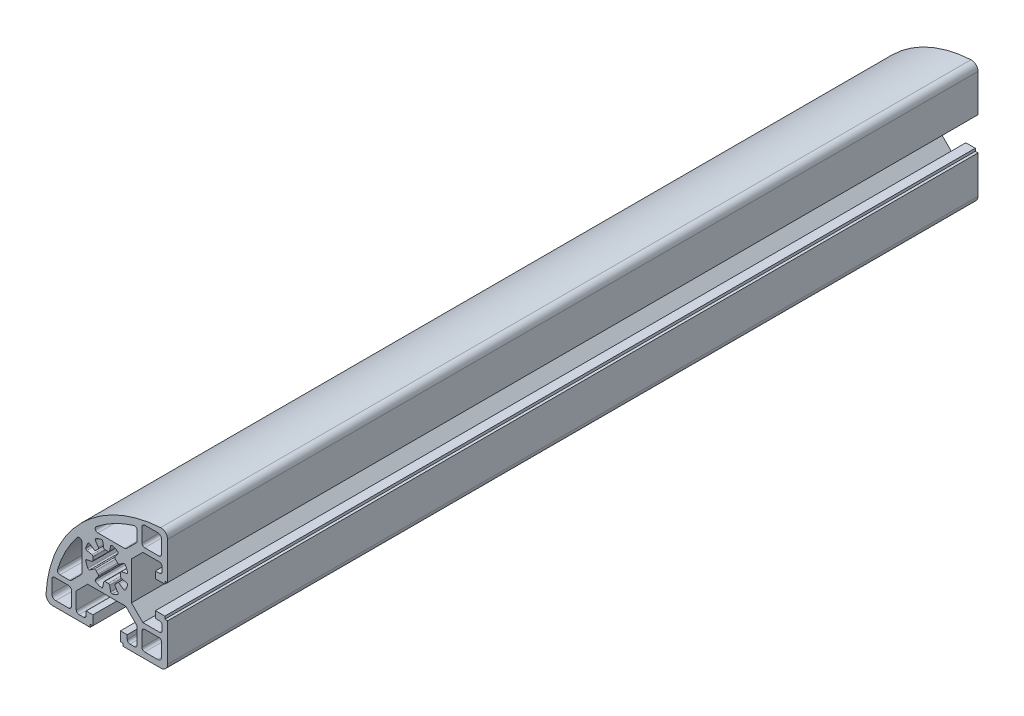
from build123d import *

# Parameters (mm, degrees)
EXTRUDE_1_DEPTH = 150


with BuildPart() as part:
    # Sketch 1 → Extrude 1 (new, symmetric)
    with BuildSketch(Plane.XY):
        with BuildLine():
            Line((22.535502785, -6.109625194), (21.533924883, -6.109625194))
            Line((21.533924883, -6.109625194), (21.533924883, -5.108047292))
            Line((21.533924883, -5.108047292), (18.028402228, -5.108047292))
            Line((18.028402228, -5.108047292), (18.028402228, -7.611992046))
            Line((18.028402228, -7.611992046), (19.53076908, -7.611992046))
            ThreePointArc((19.53076908, -7.611992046), (20.238991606, -7.905347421), (20.532346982, -8.613569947))
            Line((20.532346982, -8.613569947), (20.532346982, -10.266173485))
            ThreePointArc((20.532346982, -10.266173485), (20.238991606, -10.974396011), (19.53076908, -11.267751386))
            Line((19.53076908, -11.267751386), (13.392418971, -11.267751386))
            Line((13.392418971, -11.267751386), (9.161591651, -7.036924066))
            Line((9.161591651, -7.036924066), (9.161591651, 7.036924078))
            Line((9.161591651, 7.036924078), (13.392418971, 11.267751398))
            Line((13.392418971, 11.267751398), (19.53076908, 11.267751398))
            ThreePointArc((19.53076908, 11.267751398), (20.238991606, 10.974396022), (20.532346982, 10.266173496))
            Line((20.532346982, 10.266173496), (20.532346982, 8.613569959))
            ThreePointArc((20.532346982, 8.613569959), (20.238991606, 7.905347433), (19.53076908, 7.611992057))
            Line((19.53076908, 7.611992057), (18.028402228, 7.611992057))
            Line((18.028402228, 7.611992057), (18.028402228, 5.108047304))
            Line((18.028402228, 5.108047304), (21.533924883, 5.108047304))
            Line((21.533924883, 5.108047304), (21.533924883, 6.109625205))
            Line((21.533924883, 6.109625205), (22.535502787, 6.109625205))
            Line((22.535502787, 6.109625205), (22.535502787, 20.008667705))
            ThreePointArc((22.535502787, 20.008667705), (21.765369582, 21.794667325), (19.937953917, 22.460589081))
            ThreePointArc((19.937953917, 22.460589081), (-9.334510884, 9.334510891), (-22.460589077, -19.937953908))
            ThreePointArc((-22.460589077, -19.937953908), (-21.794667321, -21.765369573), (-20.008667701, -22.535502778))
            Line((-20.008667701, -22.535502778), (-6.109625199, -22.535502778))
            Line((-6.109625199, -22.535502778), (-6.109625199, -21.533924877))
            Line((-6.109625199, -21.533924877), (-5.108047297, -21.533924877))
            Line((-5.108047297, -21.533924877), (-5.108047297, -18.028402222))
            Line((-5.108047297, -18.028402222), (-7.611992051, -18.028402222))
            Line((-7.611992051, -18.028402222), (-7.611992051, -19.530769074))
            ThreePointArc((-7.611992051, -19.530769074), (-7.905347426, -20.2389916), (-8.613569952, -20.532346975))
            Line((-8.613569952, -20.532346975), (-10.26617349, -20.532346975))
            ThreePointArc((-10.26617349, -20.532346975), (-10.974396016, -20.2389916), (-11.267751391, -19.530769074))
            Line((-11.267751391, -19.530769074), (-11.267751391, -13.392418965))
            Line((-11.267751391, -13.392418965), (-7.036924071, -9.161591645))
            Line((-7.036924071, -9.161591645), (7.036924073, -9.161591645))
            Line((7.036924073, -9.161591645), (11.267751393, -13.392418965))
            Line((11.267751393, -13.392418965), (11.267751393, -19.530769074))
            ThreePointArc((11.267751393, -19.530769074), (10.974396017, -20.2389916), (10.266173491, -20.532346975))
            Line((10.266173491, -20.532346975), (8.613569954, -20.532346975))
            ThreePointArc((8.613569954, -20.532346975), (7.905347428, -20.2389916), (7.611992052, -19.530769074))
            Line((7.611992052, -19.530769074), (7.611992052, -18.028402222))
            Line((7.611992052, -18.028402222), (5.108047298, -18.028402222))
            Line((5.108047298, -18.028402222), (5.108047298, -21.533924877))
            Line((5.108047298, -21.533924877), (6.1096252, -21.533924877))
            Line((6.1096252, -21.533924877), (6.1096252, -22.535502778))
            Line((6.1096252, -22.535502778), (20.031558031, -22.535502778))
            ThreePointArc((20.031558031, -22.535502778), (21.802114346, -21.80211434), (22.535502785, -20.031558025))
            Line((22.535502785, -20.031558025), (22.535502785, -6.109625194))
        make_face()
        with BuildLine():
            Line((13.070591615, 14.072169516), (13.070591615, 19.330453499))
            ThreePointArc((13.070591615, 19.330453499), (13.36394699, 20.038676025), (14.072169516, 20.332031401))
            Line((14.072169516, 20.332031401), (18.829664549, 20.332031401))
            ThreePointArc((18.829664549, 20.332031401), (19.891998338, 19.891998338), (20.332031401, 18.829664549))
            Line((20.332031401, 18.829664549), (20.332031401, 14.072169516))
            ThreePointArc((20.332031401, 14.072169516), (20.038676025, 13.36394699), (19.330453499, 13.070591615))
            Line((19.330453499, 13.070591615), (14.072169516, 13.070591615))
            ThreePointArc((14.072169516, 13.070591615), (13.36394699, 13.36394699), (13.070591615, 14.072169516))
        make_face(mode=Mode.SUBTRACT)
        with BuildLine():
            Line((13.070591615, -19.330453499), (13.070591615, -14.072169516))
            ThreePointArc((13.070591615, -14.072169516), (13.36394699, -13.36394699), (14.072169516, -13.070591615))
            Line((14.072169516, -13.070591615), (19.330453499, -13.070591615))
            ThreePointArc((19.330453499, -13.070591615), (20.038676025, -13.36394699), (20.332031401, -14.072169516))
            Line((20.332031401, -14.072169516), (20.332031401, -18.829664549))
            ThreePointArc((20.332031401, -18.829664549), (19.891998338, -19.891998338), (18.829664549, -20.332031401))
            Line((18.829664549, -20.332031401), (14.072169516, -20.332031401))
            ThreePointArc((14.072169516, -20.332031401), (13.36394699, -20.038676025), (13.070591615, -19.330453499))
        make_face(mode=Mode.SUBTRACT)
        with BuildLine():
            Line((-19.330453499, -13.070591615), (-14.072169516, -13.070591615))
            ThreePointArc((-14.072169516, -13.070591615), (-13.36394699, -13.36394699), (-13.070591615, -14.072169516))
            Line((-13.070591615, -14.072169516), (-13.070591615, -19.330453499))
            ThreePointArc((-13.070591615, -19.330453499), (-13.36394699, -20.038676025), (-14.072169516, -20.332031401))
            Line((-14.072169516, -20.332031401), (-18.829664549, -20.332031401))
            ThreePointArc((-18.829664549, -20.332031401), (-19.891998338, -19.891998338), (-20.332031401, -18.829664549))
            Line((-20.332031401, -18.829664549), (-20.332031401, -14.072169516))
            ThreePointArc((-20.332031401, -14.072169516), (-20.038676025, -13.36394699), (-19.330453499, -13.070591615))
        make_face(mode=Mode.SUBTRACT)
        with BuildLine():
            Line((10.980012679, 13.10468026), (7.324662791, 9.449330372))
            ThreePointArc((7.324662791, 9.449330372), (7.00594883, 9.236372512), (6.630000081, 9.161591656))
            Line((6.630000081, 9.161591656), (-3.258372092, 9.161591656))
            ThreePointArc((-3.258372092, 9.161591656), (-4.186455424, 9.821853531), (-3.867028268, 10.915128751))
            ThreePointArc((-3.867028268, 10.915128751), (2.727508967, 15.196205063), (9.996284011, 18.192944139))
            ThreePointArc((9.996284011, 18.192944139), (10.868931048, 18.044315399), (11.267751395, 17.25403337))
            Line((11.267751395, 17.25403337), (11.267751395, 13.79934297))
            ThreePointArc((11.267751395, 13.79934297), (11.192970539, 13.423394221), (10.980012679, 13.10468026))
        make_face(mode=Mode.SUBTRACT)
        with BuildLine():
            Line((-9.449330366, -7.324662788), (-13.104680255, -10.980012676))
            ThreePointArc((-13.104680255, -10.980012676), (-13.423394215, -11.192970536), (-13.799342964, -11.267751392))
            Line((-13.799342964, -11.267751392), (-17.254033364, -11.267751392))
            ThreePointArc((-17.254033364, -11.267751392), (-18.044315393, -10.868931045), (-18.192944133, -9.996284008))
            ThreePointArc((-18.192944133, -9.996284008), (-15.196205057, -2.727508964), (-10.915128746, 3.867028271))
            ThreePointArc((-10.915128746, 3.867028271), (-9.821853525, 4.186455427), (-9.16159165, 3.258372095))
            Line((-9.16159165, 3.258372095), (-9.16159165, -6.630000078))
            ThreePointArc((-9.16159165, -6.630000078), (-9.236372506, -7.005948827), (-9.449330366, -7.324662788))
        make_face(mode=Mode.SUBTRACT)
        with BuildLine():
            Line((-6.231966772, 4.164067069), (-4.644950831, 3.103656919))
            ThreePointArc((-4.644950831, 3.103656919), (-4.291074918, 3.025006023), (-3.976841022, 3.205757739))
            ThreePointArc((-3.976841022, 3.205757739), (-3.611934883, 3.611934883), (-3.205757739, 3.976841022))
            ThreePointArc((-3.205757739, 3.976841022), (-3.025006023, 4.291074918), (-3.103656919, 4.644950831))
            Line((-3.103656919, 4.644950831), (-4.164067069, 6.231966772))
            ThreePointArc((-4.164067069, 6.231966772), (-4.235311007, 6.624216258), (-3.997521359, 6.944202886))
            ThreePointArc((-3.997521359, 6.944202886), (-3.066298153, 7.402698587), (-2.08361849, 7.736967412))
            ThreePointArc((-2.08361849, 7.736967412), (-1.689211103, 7.67884537), (-1.462225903, 7.351106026))
            Line((-1.462225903, 7.351106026), (-1.089859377, 5.479093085))
            ThreePointArc((-1.089859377, 5.479093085), (-0.895245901, 5.173250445), (-0.545238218, 5.078864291))
            ThreePointArc((-0.545238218, 5.078864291), (0, 5.108047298), (0.545238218, 5.078864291))
            ThreePointArc((0.545238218, 5.078864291), (0.895245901, 5.173250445), (1.089859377, 5.479093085))
            Line((1.089859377, 5.479093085), (1.462225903, 7.351106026))
            ThreePointArc((1.462225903, 7.351106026), (1.689211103, 7.67884537), (2.08361849, 7.736967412))
            ThreePointArc((2.08361849, 7.736967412), (3.066298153, 7.402698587), (3.997521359, 6.944202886))
            ThreePointArc((3.997521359, 6.944202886), (4.235311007, 6.624216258), (4.164067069, 6.231966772))
            Line((4.164067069, 6.231966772), (3.103656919, 4.64495083))
            ThreePointArc((3.103656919, 4.64495083), (3.025006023, 4.291074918), (3.205757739, 3.976841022))
            ThreePointArc((3.205757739, 3.976841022), (3.611934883, 3.611934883), (3.976841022, 3.205757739))
            ThreePointArc((3.976841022, 3.205757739), (4.291074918, 3.025006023), (4.64495083, 3.103656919))
            Line((4.64495083, 3.103656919), (6.231966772, 4.164067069))
            ThreePointArc((6.231966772, 4.164067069), (6.624216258, 4.235311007), (6.944202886, 3.997521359))
            ThreePointArc((6.944202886, 3.997521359), (7.402698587, 3.066298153), (7.736967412, 2.08361849))
            ThreePointArc((7.736967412, 2.08361849), (7.67884537, 1.689211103), (7.351106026, 1.462225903))
            Line((7.351106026, 1.462225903), (5.479093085, 1.089859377))
            ThreePointArc((5.479093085, 1.089859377), (5.173250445, 0.895245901), (5.078864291, 0.545238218))
            ThreePointArc((5.078864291, 0.545238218), (5.108047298, 0), (5.078864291, -0.545238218))
            ThreePointArc((5.078864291, -0.545238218), (5.173250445, -0.895245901), (5.479093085, -1.089859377))
            Line((5.479093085, -1.089859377), (7.351106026, -1.462225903))
            ThreePointArc((7.351106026, -1.462225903), (7.67884537, -1.689211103), (7.736967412, -2.08361849))
            ThreePointArc((7.736967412, -2.08361849), (7.402698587, -3.066298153), (6.944202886, -3.997521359))
            ThreePointArc((6.944202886, -3.997521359), (6.624216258, -4.235311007), (6.231966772, -4.164067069))
            Line((6.231966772, -4.164067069), (4.64495083, -3.103656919))
            ThreePointArc((4.64495083, -3.103656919), (4.291074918, -3.025006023), (3.976841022, -3.205757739))
            ThreePointArc((3.976841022, -3.205757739), (3.611934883, -3.611934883), (3.205757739, -3.976841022))
            ThreePointArc((3.205757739, -3.976841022), (3.025006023, -4.291074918), (3.103656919, -4.644950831))
            Line((3.103656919, -4.644950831), (4.164067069, -6.231966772))
            ThreePointArc((4.164067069, -6.231966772), (4.235311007, -6.624216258), (3.997521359, -6.944202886))
            ThreePointArc((3.997521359, -6.944202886), (3.066298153, -7.402698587), (2.08361849, -7.736967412))
            ThreePointArc((2.08361849, -7.736967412), (1.689211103, -7.67884537), (1.462225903, -7.351106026))
            Line((1.462225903, -7.351106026), (1.089859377, -5.479093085))
            ThreePointArc((1.089859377, -5.479093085), (0.895245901, -5.173250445), (0.545238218, -5.078864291))
            ThreePointArc((0.545238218, -5.078864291), (0, -5.108047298), (-0.545238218, -5.078864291))
            ThreePointArc((-0.545238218, -5.078864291), (-0.895245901, -5.173250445), (-1.089859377, -5.479093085))
            Line((-1.089859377, -5.479093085), (-1.462225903, -7.351106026))
            ThreePointArc((-1.462225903, -7.351106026), (-1.689211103, -7.67884537), (-2.08361849, -7.736967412))
            ThreePointArc((-2.08361849, -7.736967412), (-3.066298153, -7.402698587), (-3.997521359, -6.944202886))
            ThreePointArc((-3.997521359, -6.944202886), (-4.235311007, -6.624216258), (-4.164067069, -6.231966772))
            Line((-4.164067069, -6.231966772), (-3.103656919, -4.644950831))
            ThreePointArc((-3.103656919, -4.644950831), (-3.025006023, -4.291074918), (-3.205757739, -3.976841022))
            ThreePointArc((-3.205757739, -3.976841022), (-3.611934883, -3.611934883), (-3.976841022, -3.205757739))
            ThreePointArc((-3.976841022, -3.205757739), (-4.291074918, -3.025006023), (-4.644950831, -3.103656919))
            Line((-4.644950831, -3.103656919), (-6.231966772, -4.164067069))
            ThreePointArc((-6.231966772, -4.164067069), (-6.624216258, -4.235311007), (-6.944202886, -3.997521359))
            ThreePointArc((-6.944202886, -3.997521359), (-7.402698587, -3.066298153), (-7.736967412, -2.08361849))
            ThreePointArc((-7.736967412, -2.08361849), (-7.67884537, -1.689211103), (-7.351106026, -1.462225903))
            Line((-7.351106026, -1.462225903), (-5.479093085, -1.089859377))
            ThreePointArc((-5.479093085, -1.089859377), (-5.173250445, -0.895245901), (-5.078864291, -0.545238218))
            ThreePointArc((-5.078864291, -0.545238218), (-5.108047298, 0), (-5.078864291, 0.545238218))
            ThreePointArc((-5.078864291, 0.545238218), (-5.173250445, 0.895245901), (-5.479093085, 1.089859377))
            Line((-5.479093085, 1.089859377), (-7.351106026, 1.462225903))
            ThreePointArc((-7.351106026, 1.462225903), (-7.67884537, 1.689211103), (-7.736967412, 2.08361849))
            ThreePointArc((-7.736967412, 2.08361849), (-7.402698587, 3.066298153), (-6.944202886, 3.997521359))
            ThreePointArc((-6.944202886, 3.997521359), (-6.624216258, 4.235311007), (-6.231966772, 4.164067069))
        make_face(mode=Mode.SUBTRACT)
    extrude(amount=EXTRUDE_1_DEPTH, both=True)


solid = part.part
